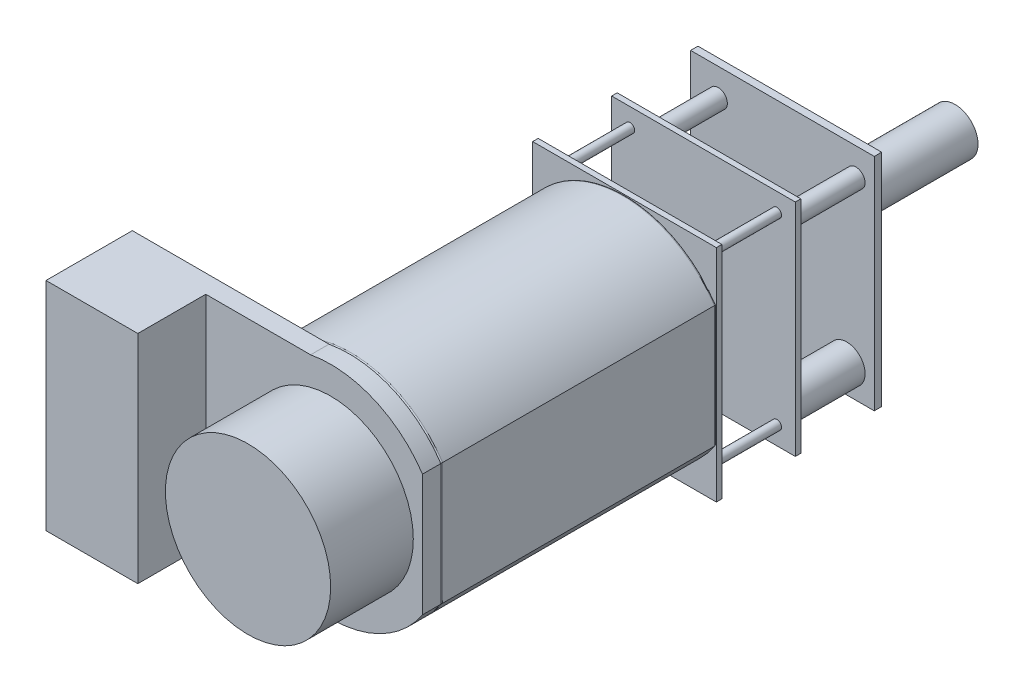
from build123d import *

# Parameters (mm, degrees)
BOSS_EXTRUDE1_DEPTH  = 15
FILLET1_R            = 0.1
SKETCH2_R            = 2.5
BOSS_EXTRUDE2_DEPTH  = 1
SKETCH3_R            = 1.25
BOSS_EXTRUDE3_DEPTH  = 0.1
SKETCH4_W            = 10
SKETCH4_H            = 12
BOSS_EXTRUDE4_DEPTH  = 0.3
SKETCH5_R            = 0.5
BOSS_EXTRUDE5_DEPTH  = 1
SKETCH6_R            = 0.5
BOSS_EXTRUDE6_DEPTH  = 0.5
SKETCH8_R            = 0.25
BOSS_EXTRUDE7_DEPTH  = 4
SKETCH9_W            = 10
SKETCH9_H            = 12
BOSS_EXTRUDE8_DEPTH  = 0.3
SKETCH10_R           = 0.5
SKETCH10_R_2         = 1
BOSS_EXTRUDE9_DEPTH  = 4
SKETCH11_W           = 10
SKETCH11_H           = 12
BOSS_EXTRUDE10_DEPTH = 0.4
BOSS_EXTRUDE11_START = 9
SKETCH14_R           = 1.25
BOSS_EXTRUDE11_DEPTH = 9
SKETCH15_R           = 1.5
BOSS_EXTRUDE12_DEPTH = 0.8
BOSS_EXTRUDE13_DEPTH = 1
SKETCH17_R           = 4.5
BOSS_EXTRUDE14_DEPTH = 4.5
SKETCH18_W           = 5
SKETCH18_H           = 11.8
BOSS_EXTRUDE15_DEPTH = 3.7
SKETCH19_W           = 4.1
SKETCH19_H           = 11.6
CUT_EXTRUDE1_DEPTH   = 3.2
ESCALA1_SCALE        = 1.5


with BuildPart() as part:
    # Sketch1 → Boss-Extrude1 (new body)
    with BuildSketch(Plane.XY):
        with BuildLine():
            Line((-5, -3.31662479), (-5, 3.31662479))
            ThreePointArc((-5, 3.31662479), (0, 6), (5, 3.31662479))
            Line((5, 3.31662479), (5, -3.31662479))
            ThreePointArc((5, -3.31662479), (0, -6), (-5, -3.31662479))
        make_face()
    extrude(amount=BOSS_EXTRUDE1_DEPTH)

    # Fillet1
    fillet1_edges = [part.edges().sort_by_distance(p)[0] for p in [
        (0, 6, 15),
        (-5, 0, 15),
        (0, -6, 15),
        (-5, 0, 0),
        (0, 6, 0),
        (5, 0, 0),
        (0, -6, 0),
        (5, 0, 15),
    ]]
    fillet(fillet1_edges, radius=FILLET1_R)

    # Sketch2 → Boss-Extrude2 (add)
    with BuildSketch(Plane.XY.offset(15)):
        Circle(SKETCH2_R)
    extrude(amount=BOSS_EXTRUDE2_DEPTH)

    # Sketch3 → Boss-Extrude3 (add)
    with BuildSketch(Plane.XY.offset(16)):
        Circle(SKETCH3_R)
    extrude(amount=BOSS_EXTRUDE3_DEPTH)

    # Sketch4 → Boss-Extrude4 (add)
    with BuildSketch(Plane(origin=(0, 0, 0), x_dir=(-1, 0, 0), z_dir=(0, 0, -1))):
        Rectangle(SKETCH4_W, SKETCH4_H)
    extrude(amount=BOSS_EXTRUDE4_DEPTH)

    # Sketch5 → Boss-Extrude5 (add)
    with BuildSketch(Plane(origin=(0, 0, -0.3), x_dir=(-1, 0, 0), z_dir=(0, 0, -1))):
        with Locations(Location((0, 0, 0), (0, 0, 180))):
            Circle(SKETCH5_R)
    extrude(amount=BOSS_EXTRUDE5_DEPTH)

    # Sketch6 → Boss-Extrude6 (add)
    with BuildSketch(Plane(origin=(0, 0, -0.3), x_dir=(-1, 0, 0), z_dir=(0, 0, -1))):
        with BuildLine():
            Line((-0.1, 1.496662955), (0, 1.669868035))
            Line((0, 1.669868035), (0.1, 1.496662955))
            ThreePointArc((0.1, 1.496662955), (0.134458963, 1.493961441), (0.168846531, 1.490466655))
            Line((0.168846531, 1.490466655), (0.298166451, 1.643032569))
            Line((0.298166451, 1.643032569), (0.365632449, 1.454755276))
            ThreePointArc((0.365632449, 1.454755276), (0.399055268, 1.445944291), (0.432266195, 1.43636553))
            Line((0.432266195, 1.43636553), (0.586749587, 1.563388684))
            Line((0.586749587, 1.563388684), (0.619513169, 1.366090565))
            ThreePointArc((0.619513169, 1.366090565), (0.650825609, 1.351453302), (0.681792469, 1.336098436))
            Line((0.681792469, 1.336098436), (0.856474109, 1.433496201))
            Line((0.856474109, 1.433496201), (0.853482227, 1.23351858))
            ThreePointArc((0.853482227, 1.23351858), (0.881677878, 1.213525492), (0.909405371, 1.192888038))
            Line((0.909405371, 1.192888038), (1.098670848, 1.25752997))
            Line((1.098670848, 1.25752997), (1.060019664, 1.061300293))
            ThreePointArc((1.060019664, 1.061300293), (1.084192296, 1.036593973), (1.107789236, 1.011337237))
            Line((1.107789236, 1.011337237), (1.305555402, 1.041145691))
            Line((1.305555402, 1.041145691), (1.232487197, 0.854970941))
            ThreePointArc((1.232487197, 0.854970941), (1.251859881, 0.826345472), (1.270567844, 0.797281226))
            Line((1.270567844, 0.797281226), (1.470478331, 0.791298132))
            Line((1.470478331, 0.791298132), (1.365341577, 0.621162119))
            ThreePointArc((1.365341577, 0.621162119), (1.379291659, 0.589537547), (1.392509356, 0.557599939))
            Line((1.392509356, 0.557599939), (1.588138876, 0.516017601))
            Line((1.588138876, 0.516017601), (1.454312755, 0.367388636))
            ThreePointArc((1.454312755, 0.367388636), (1.462391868, 0.333781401), (1.469694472, 0.299996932))
            Line((1.469694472, 0.299996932), (1.654755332, 0.22415184))
            Line((1.654755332, 0.22415184), (1.496541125, 0.10180698))
            ThreePointArc((1.496541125, 0.10180698), (1.4984896, 0.067297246), (1.499642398, 0.032751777))
            Line((1.499642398, 0.032751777), (1.668186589, -0.074918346))
            Line((1.668186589, -0.074918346), (1.490669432, -0.167046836))
            ThreePointArc((1.490669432, -0.167046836), (1.486424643, -0.201349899), (1.481390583, -0.235546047))
            Line((1.481390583, -0.235546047), (1.628000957, -0.371580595))
            Line((1.628000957, -0.371580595), (1.436886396, -0.43053163))
            ThreePointArc((1.436886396, -0.43053163), (1.426584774, -0.463525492), (1.415525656, -0.496273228))
            Line((1.415525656, -0.496273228), (1.535490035, -0.656299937))
            Line((1.535490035, -0.656299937), (1.33692065, -0.680178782))
            ThreePointArc((1.33692065, -0.680178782), (1.320893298, -0.710802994), (1.30416457, -0.741049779))
            Line((1.30416457, -0.741049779), (1.3936272, -0.91992526))
            Line((1.3936272, -0.91992526), (1.193985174, -0.907964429))
            ThreePointArc((1.193985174, -0.907964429), (1.172747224, -0.935234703), (1.150886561, -0.96200838))
            Line((1.150886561, -0.96200838), (1.206972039, -1.153983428))
            Line((1.206972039, -1.153983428), (1.012674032, -1.106567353))
            ThreePointArc((1.012674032, -1.106567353), (0.986908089, -1.129607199), (0.960618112, -1.15204724))
            Line((0.960618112, -1.15204724), (0.981523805, -1.350951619))
            Line((0.981523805, -1.350951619), (0.798814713, -1.26960429))
            ThreePointArc((0.798814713, -1.26960429), (0.769348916, -1.28767319), (0.739474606, -1.305058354))
            Line((0.739474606, -1.305058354), (0.724528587, -1.504499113))
            Line((0.724528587, -1.504499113), (0.559280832, -1.391835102))
            ThreePointArc((0.559280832, -1.391835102), (0.527062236, -1.404352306), (0.494563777, -1.416123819))
            Line((0.494563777, -1.416123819), (0.444246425, -1.609690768))
            Line((0.444246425, -1.609690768), (0.301771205, -1.469331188))
            ThreePointArc((0.301771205, -1.469331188), (0.267835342, -1.475894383), (0.233757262, -1.481673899))
            Line((0.233757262, -1.481673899), (0.149685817, -1.663145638))
            Line((0.149685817, -1.663145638), (0.034562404, -1.499601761))
            ThreePointArc((0.034562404, -1.499601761), (0, -1.5), (-0.034562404, -1.499601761))
            Line((-0.034562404, -1.499601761), (-0.149685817, -1.663145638))
            Line((-0.149685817, -1.663145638), (-0.233757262, -1.481673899))
            ThreePointArc((-0.233757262, -1.481673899), (-0.267835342, -1.475894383), (-0.301771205, -1.469331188))
            Line((-0.301771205, -1.469331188), (-0.444246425, -1.609690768))
            Line((-0.444246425, -1.609690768), (-0.494563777, -1.416123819))
            ThreePointArc((-0.494563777, -1.416123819), (-0.527062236, -1.404352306), (-0.559280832, -1.391835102))
            Line((-0.559280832, -1.391835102), (-0.724528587, -1.504499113))
            Line((-0.724528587, -1.504499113), (-0.739474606, -1.305058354))
            ThreePointArc((-0.739474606, -1.305058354), (-0.769348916, -1.28767319), (-0.798814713, -1.26960429))
            Line((-0.798814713, -1.26960429), (-0.981523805, -1.350951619))
            Line((-0.981523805, -1.350951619), (-0.960618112, -1.15204724))
            ThreePointArc((-0.960618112, -1.15204724), (-0.986908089, -1.129607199), (-1.012674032, -1.106567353))
            Line((-1.012674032, -1.106567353), (-1.206972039, -1.153983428))
            Line((-1.206972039, -1.153983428), (-1.150886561, -0.96200838))
            ThreePointArc((-1.150886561, -0.96200838), (-1.172747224, -0.935234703), (-1.193985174, -0.907964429))
            Line((-1.193985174, -0.907964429), (-1.3936272, -0.91992526))
            Line((-1.3936272, -0.91992526), (-1.30416457, -0.741049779))
            ThreePointArc((-1.30416457, -0.741049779), (-1.320893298, -0.710802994), (-1.33692065, -0.680178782))
            Line((-1.33692065, -0.680178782), (-1.535490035, -0.656299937))
            Line((-1.535490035, -0.656299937), (-1.415525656, -0.496273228))
            ThreePointArc((-1.415525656, -0.496273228), (-1.426584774, -0.463525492), (-1.436886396, -0.43053163))
            Line((-1.436886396, -0.43053163), (-1.628000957, -0.371580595))
            Line((-1.628000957, -0.371580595), (-1.481390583, -0.235546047))
            ThreePointArc((-1.481390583, -0.235546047), (-1.486424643, -0.201349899), (-1.490669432, -0.167046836))
            Line((-1.490669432, -0.167046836), (-1.668186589, -0.074918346))
            Line((-1.668186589, -0.074918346), (-1.499642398, 0.032751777))
            ThreePointArc((-1.499642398, 0.032751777), (-1.4984896, 0.067297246), (-1.496541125, 0.10180698))
            Line((-1.496541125, 0.10180698), (-1.654755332, 0.22415184))
            Line((-1.654755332, 0.22415184), (-1.469694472, 0.299996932))
            ThreePointArc((-1.469694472, 0.299996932), (-1.462391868, 0.333781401), (-1.454312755, 0.367388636))
            Line((-1.454312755, 0.367388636), (-1.588138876, 0.516017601))
            Line((-1.588138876, 0.516017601), (-1.392509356, 0.557599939))
            ThreePointArc((-1.392509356, 0.557599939), (-1.379291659, 0.589537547), (-1.365341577, 0.621162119))
            Line((-1.365341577, 0.621162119), (-1.470478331, 0.791298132))
            Line((-1.470478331, 0.791298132), (-1.270567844, 0.797281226))
            ThreePointArc((-1.270567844, 0.797281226), (-1.251859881, 0.826345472), (-1.232487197, 0.854970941))
            Line((-1.232487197, 0.854970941), (-1.305555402, 1.041145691))
            Line((-1.305555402, 1.041145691), (-1.107789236, 1.011337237))
            ThreePointArc((-1.107789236, 1.011337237), (-1.084192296, 1.036593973), (-1.060019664, 1.061300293))
            Line((-1.060019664, 1.061300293), (-1.098670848, 1.25752997))
            Line((-1.098670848, 1.25752997), (-0.909405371, 1.192888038))
            ThreePointArc((-0.909405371, 1.192888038), (-0.881677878, 1.213525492), (-0.853482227, 1.23351858))
            Line((-0.853482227, 1.23351858), (-0.856474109, 1.433496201))
            Line((-0.856474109, 1.433496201), (-0.681792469, 1.336098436))
            ThreePointArc((-0.681792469, 1.336098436), (-0.650825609, 1.351453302), (-0.619513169, 1.366090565))
            Line((-0.619513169, 1.366090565), (-0.586749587, 1.563388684))
            Line((-0.586749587, 1.563388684), (-0.432266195, 1.43636553))
            ThreePointArc((-0.432266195, 1.43636553), (-0.399055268, 1.445944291), (-0.365632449, 1.454755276))
            Line((-0.365632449, 1.454755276), (-0.298166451, 1.643032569))
            Line((-0.298166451, 1.643032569), (-0.168846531, 1.490466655))
            ThreePointArc((-0.168846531, 1.490466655), (-0.134458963, 1.493961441), (-0.1, 1.496662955))
        make_face()
        Circle(SKETCH6_R, mode=Mode.SUBTRACT)
    extrude(amount=BOSS_EXTRUDE6_DEPTH)

    # Sketch8 → Boss-Extrude7 (add)
    with BuildSketch(Plane(origin=(0, 0, -0.3), x_dir=(-1, 0, 0), z_dir=(0, 0, -1))):
        with Locations(Location((-4, 5, 0), (0, 0, 180))):
            Circle(SKETCH8_R)
        with Locations(Location((4, 5, 0), (0, 0, 180))):
            Circle(SKETCH8_R)
        with Locations(Location((4, -5, 0), (0, 0, 180))):
            Circle(SKETCH8_R)
        with Locations(Location((-4, -5, 0), (0, 0, 180))):
            Circle(SKETCH8_R)
    extrude(amount=BOSS_EXTRUDE7_DEPTH)

    # Sketch9 → Boss-Extrude8 (add)
    with BuildSketch(Plane(origin=(0, 0, -4.3), x_dir=(-1, 0, 0), z_dir=(0, 0, -1))):
        Rectangle(SKETCH9_W, SKETCH9_H)
    extrude(amount=BOSS_EXTRUDE8_DEPTH)

    # Sketch10 → Boss-Extrude9 (add)
    with BuildSketch(Plane(origin=(0, 0, -4.6), x_dir=(-1, 0, 0), z_dir=(0, 0, -1))):
        with Locations(Location((-4, 4.5, 0), (0, 0, 180))):
            Circle(SKETCH10_R)
        with Locations(Location((-3.5, -4.5, 0), (0, 0, 180))):
            Circle(SKETCH10_R_2)
        with Locations(Location((3.5, 4.5, 0), (0, 0, 180))):
            Circle(SKETCH10_R)
    extrude(amount=BOSS_EXTRUDE9_DEPTH)

    # Sketch11 → Boss-Extrude10 (add)
    with BuildSketch(Plane(origin=(0, 0, -8.6), x_dir=(-1, 0, 0), z_dir=(0, 0, -1))):
        Rectangle(SKETCH11_W, SKETCH11_H)
    extrude(amount=BOSS_EXTRUDE10_DEPTH)

    # Sketch14 → Boss-Extrude11 (add)
    with BuildSketch(Plane(origin=(0, 0, -9), x_dir=(-1, 0, 0), z_dir=(0, 0, -1)).offset(BOSS_EXTRUDE11_START)):
        with Locations(Location((0, 0, 0), (0, 0, 180))):
            Circle(SKETCH14_R)
    extrude(amount=-BOSS_EXTRUDE11_DEPTH)

    # Sketch15 → Boss-Extrude12 (add)
    with BuildSketch(Plane(origin=(0, 0, -9), x_dir=(-1, 0, 0), z_dir=(0, 0, -1))):
        with Locations(Location((0, 0, 0), (0, 0, 180))):
            Circle(SKETCH15_R)
    extrude(amount=BOSS_EXTRUDE12_DEPTH)

    # Sketch16 → Boss-Extrude13 (add)
    with BuildSketch(Plane.XY.offset(15)):
        with BuildLine():
            Line((5, -3.31662479), (5, 3.31662479))
            ThreePointArc((5, 3.31662479), (2.342814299, 5.523696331), (-1.090871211, 5.9))
            Line((-1.090871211, 5.9), (-11.8, 5.9))
            Line((-11.8, 5.9), (-11.8, -5.9))
            Line((-11.8, -5.9), (-1.090871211, -5.9))
            ThreePointArc((-1.090871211, -5.9), (2.342814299, -5.523696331), (5, -3.31662479))
        make_face()
    extrude(amount=BOSS_EXTRUDE13_DEPTH)

    # Sketch17 → Boss-Extrude14 (add)
    with BuildSketch(Plane.XY.offset(16)):
        Circle(SKETCH17_R)
    extrude(amount=BOSS_EXTRUDE14_DEPTH)

    # Sketch18 → Boss-Extrude15 (add)
    with BuildSketch(Plane.XY.offset(16)):
        with Locations((-9.3, 0)):
            Rectangle(SKETCH18_W, SKETCH18_H)
    extrude(amount=BOSS_EXTRUDE15_DEPTH)

    # Sketch19 → Cut-Extrude1 (cut)
    with BuildSketch(Plane.ZY.offset(11.8)):
        with Locations((17.55, 0)):
            Rectangle(SKETCH19_W, SKETCH19_H)
    extrude(amount=-CUT_EXTRUDE1_DEPTH, mode=Mode.SUBTRACT)


with BuildPart() as part_1:
    # Escala1: scaled about (0, 0, 0)
    add(part.part.scale(ESCALA1_SCALE))


solid = part_1.part
